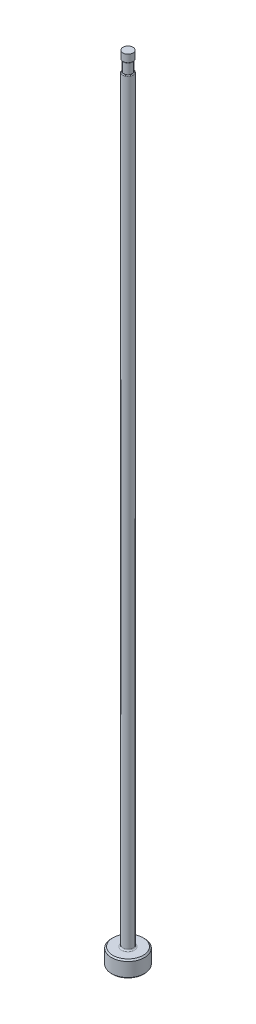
ISO-10303-21;
HEADER;
FILE_DESCRIPTION(('STEP AP214'),'2;1');
FILE_NAME('part.step','',(''),(''),'','','');
FILE_SCHEMA(('AUTOMOTIVE_DESIGN { 1 0 10303 214 1 1 1 1 }'));
ENDSEC;
DATA;
#1=APPLICATION_CONTEXT('core data for automotive mechanical design processes');
#2=APPLICATION_PROTOCOL_DEFINITION('international standard','automotive_design',2000,#1);
#3=PRODUCT_CONTEXT('',#1,'mechanical');
#4=PRODUCT('Part','Part','',(#3));
#5=PRODUCT_RELATED_PRODUCT_CATEGORY('part','',(#4));
#6=PRODUCT_DEFINITION_FORMATION('','',#4);
#7=PRODUCT_DEFINITION_CONTEXT('part definition',#1,'design');
#8=PRODUCT_DEFINITION('design','',#6,#7);
#9=PRODUCT_DEFINITION_SHAPE('','',#8);
#10=(LENGTH_UNIT() NAMED_UNIT(*) SI_UNIT(.MILLI.,.METRE.));
#11=(NAMED_UNIT(*) PLANE_ANGLE_UNIT() SI_UNIT($,.RADIAN.));
#12=(NAMED_UNIT(*) SI_UNIT($,.STERADIAN.) SOLID_ANGLE_UNIT());
#13=UNCERTAINTY_MEASURE_WITH_UNIT(LENGTH_MEASURE(1.E-05),#10,'distance_accuracy_value','');
#14=(GEOMETRIC_REPRESENTATION_CONTEXT(3) GLOBAL_UNCERTAINTY_ASSIGNED_CONTEXT((#13)) GLOBAL_UNIT_ASSIGNED_CONTEXT((#10,
#11,#12)) REPRESENTATION_CONTEXT('',''));
#15=CARTESIAN_POINT('',(0.,0.,0.));
#16=DIRECTION('',(0.,0.,1.));
#17=DIRECTION('',(1.,0.,0.));
#18=AXIS2_PLACEMENT_3D('',#15,#16,#17);
#19=CARTESIAN_POINT('',(-0.991869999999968,150.876,0.));
#20=DIRECTION('',(0.,1.,0.));
#21=DIRECTION('',(0.,0.,1.));
#22=AXIS2_PLACEMENT_3D('',#19,#20,#21);
#23=PLANE('',#22);
#24=CARTESIAN_POINT('',(0.,150.876,0.));
#25=DIRECTION('',(0.,1.,0.));
#26=DIRECTION('',(0.,0.,1.));
#27=AXIS2_PLACEMENT_3D('',#24,#25,#26);
#28=CIRCLE('',#27,0.839469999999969);
#29=CARTESIAN_POINT('',(0.,150.876,0.839469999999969));
#30=VERTEX_POINT('',#29);
#31=EDGE_CURVE('E11',#30,#30,#28,.F.);
#32=ORIENTED_EDGE('',*,*,#31,.T.);
#33=EDGE_LOOP('',(#32));
#34=FACE_BOUND('',#33,.T.);
#35=CARTESIAN_POINT('',(0.,150.876,0.));
#36=DIRECTION('',(0.,1.,0.));
#37=DIRECTION('',(0.,0.,1.));
#38=AXIS2_PLACEMENT_3D('',#35,#36,#37);
#39=CIRCLE('',#38,0.788669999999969);
#40=CARTESIAN_POINT('',(0.,150.876,0.788669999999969));
#41=VERTEX_POINT('',#40);
#42=EDGE_CURVE('E78',#41,#41,#39,.T.);
#43=ORIENTED_EDGE('',*,*,#42,.T.);
#44=EDGE_LOOP('',(#43));
#45=FACE_BOUND('',#44,.T.);
#46=ADVANCED_FACE('F36',(#34,#45),#23,.F.);
#47=CARTESIAN_POINT('',(0.,259.958771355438,0.));
#48=DIRECTION('',(0.,1.,0.));
#49=DIRECTION('',(0.,0.,1.));
#50=AXIS2_PLACEMENT_3D('',#47,#48,#49);
#51=CYLINDRICAL_SURFACE('',#50,0.991869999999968);
#52=DIRECTION('',(0.,1.,0.));
#53=VECTOR('',#52,1.);
#54=CARTESIAN_POINT('',(-0.788669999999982,259.958771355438,-0.601502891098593));
#55=LINE('',#54,#53);
#56=CARTESIAN_POINT('',(-0.788669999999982,148.717,-0.601502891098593));
#57=VERTEX_POINT('',#56);
#58=CARTESIAN_POINT('',(-0.788669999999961,86.36,-0.601502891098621));
#59=VERTEX_POINT('',#58);
#60=EDGE_CURVE('E73',#57,#59,#55,.F.);
#61=ORIENTED_EDGE('',*,*,#60,.F.);
#62=CARTESIAN_POINT('',(0.,148.717,0.));
#63=DIRECTION('',(0.,-1.,0.));
#64=DIRECTION('',(0.,0.,-1.));
#65=AXIS2_PLACEMENT_3D('',#62,#63,#64);
#66=CIRCLE('',#65,0.991869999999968);
#67=CARTESIAN_POINT('',(-0.788669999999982,148.717,0.601502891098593));
#68=VERTEX_POINT('',#67);
#69=EDGE_CURVE('E51',#57,#68,#66,.T.);
#70=ORIENTED_EDGE('',*,*,#69,.T.);
#71=DIRECTION('',(0.,1.,0.));
#72=VECTOR('',#71,1.);
#73=CARTESIAN_POINT('',(-0.788669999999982,259.958771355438,0.601502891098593));
#74=LINE('',#73,#72);
#75=CARTESIAN_POINT('',(-0.788669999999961,86.36,0.601502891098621));
#76=VERTEX_POINT('',#75);
#77=EDGE_CURVE('E84',#76,#68,#74,.T.);
#78=ORIENTED_EDGE('',*,*,#77,.F.);
#79=CARTESIAN_POINT('',(-0.78866999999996,86.36,-0.601502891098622));
#80=CARTESIAN_POINT('',(-0.788666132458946,86.3183657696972,-0.601487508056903));
#81=CARTESIAN_POINT('',(-0.789488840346,86.2767268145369,-0.600428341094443));
#82=CARTESIAN_POINT('',(-0.792762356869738,86.1935772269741,-0.596110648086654));
#83=CARTESIAN_POINT('',(-0.795215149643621,86.1520668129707,-0.5928494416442));
#84=CARTESIAN_POINT('',(-0.801750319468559,86.0690760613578,-0.583979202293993));
#85=CARTESIAN_POINT('',(-0.80584587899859,86.0275987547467,-0.578351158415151));
#86=CARTESIAN_POINT('',(-0.815598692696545,85.9452848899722,-0.564514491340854));
#87=CARTESIAN_POINT('',(-0.821255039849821,85.9044479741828,-0.556307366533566));
#88=CARTESIAN_POINT('',(-0.835799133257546,85.8124854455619,-0.534292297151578));
#89=CARTESIAN_POINT('',(-0.845147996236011,85.7616464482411,-0.51956237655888));
#90=CARTESIAN_POINT('',(-0.865829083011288,85.6624630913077,-0.484320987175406));
#91=CARTESIAN_POINT('',(-0.877157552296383,85.6141142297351,-0.463820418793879));
#92=CARTESIAN_POINT('',(-0.898053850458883,85.5330057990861,-0.421558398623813));
#93=CARTESIAN_POINT('',(-0.907358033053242,85.4993614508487,-0.401380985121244));
#94=CARTESIAN_POINT('',(-0.926056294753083,85.4355419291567,-0.356125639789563));
#95=CARTESIAN_POINT('',(-0.935450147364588,85.4053597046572,-0.331057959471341));
#96=CARTESIAN_POINT('',(-0.950231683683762,85.3599121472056,-0.285005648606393));
#97=CARTESIAN_POINT('',(-0.955876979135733,85.3431082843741,-0.265630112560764));
#98=CARTESIAN_POINT('',(-0.966384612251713,85.312543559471,-0.224405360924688));
#99=CARTESIAN_POINT('',(-0.971247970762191,85.2987787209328,-0.202559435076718));
#100=CARTESIAN_POINT('',(-0.978947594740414,85.2773348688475,-0.16073053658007));
#101=CARTESIAN_POINT('',(-0.981991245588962,85.2690060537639,-0.141121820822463));
#102=CARTESIAN_POINT('',(-0.986954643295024,85.2555350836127,-0.100697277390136));
#103=CARTESIAN_POINT('',(-0.988875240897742,85.2503905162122,-0.0798823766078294));
#104=CARTESIAN_POINT('',(-0.991389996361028,85.2436710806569,-0.0374802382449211));
#105=CARTESIAN_POINT('',(-0.991977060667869,85.2421153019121,-0.0158894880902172));
#106=CARTESIAN_POINT('',(-0.991730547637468,85.2427708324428,0.0272258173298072));
#107=CARTESIAN_POINT('',(-0.990897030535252,85.2449819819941,0.0487503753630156));
#108=CARTESIAN_POINT('',(-0.988037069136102,85.2526392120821,0.0892607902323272));
#109=CARTESIAN_POINT('',(-0.986115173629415,85.257802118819,0.108309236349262));
#110=CARTESIAN_POINT('',(-0.98134109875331,85.2707860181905,0.145344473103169));
#111=CARTESIAN_POINT('',(-0.978488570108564,85.2786080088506,0.163330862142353));
#112=CARTESIAN_POINT('',(-0.970708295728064,85.3002895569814,0.205331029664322));
#113=CARTESIAN_POINT('',(-0.96541298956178,85.3153036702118,0.228680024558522));
#114=CARTESIAN_POINT('',(-0.953964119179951,85.3487581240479,0.272534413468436));
#115=CARTESIAN_POINT('',(-0.947808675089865,85.3672059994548,0.293033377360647));
#116=CARTESIAN_POINT('',(-0.931801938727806,85.4169271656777,0.341318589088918));
#117=CARTESIAN_POINT('',(-0.921702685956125,85.4498591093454,0.367302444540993));
#118=CARTESIAN_POINT('',(-0.901756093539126,85.5193884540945,0.413864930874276));
#119=CARTESIAN_POINT('',(-0.891909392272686,85.5559941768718,0.434430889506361));
#120=CARTESIAN_POINT('',(-0.874578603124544,85.6256825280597,0.468207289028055));
#121=CARTESIAN_POINT('',(-0.866965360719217,85.6584263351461,0.482064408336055));
#122=CARTESIAN_POINT('',(-0.852602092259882,85.72513810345,0.507032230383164));
#123=CARTESIAN_POINT('',(-0.845852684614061,85.7591069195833,0.518140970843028));
#124=CARTESIAN_POINT('',(-0.827119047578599,85.8624444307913,0.547946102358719));
#125=CARTESIAN_POINT('',(-0.816676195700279,85.9331386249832,0.56307398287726));
#126=CARTESIAN_POINT('',(-0.801997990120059,86.063402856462,0.583716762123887));
#127=CARTESIAN_POINT('',(-0.796987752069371,86.1227084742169,0.590464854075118));
#128=CARTESIAN_POINT('',(-0.791992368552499,86.21180696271,0.597127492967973));
#129=CARTESIAN_POINT('',(-0.790747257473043,86.2414091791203,0.598772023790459));
#130=CARTESIAN_POINT('',(-0.789085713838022,86.3006736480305,0.600958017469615));
#131=CARTESIAN_POINT('',(-0.788669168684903,86.3303358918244,0.601499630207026));
#132=CARTESIAN_POINT('',(-0.788669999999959,86.36,0.601502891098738));
#133=B_SPLINE_CURVE_WITH_KNOTS('',3,(#79,#80,#81,#82,#83,#84,#85,#86,#87,#88,#89,#90,#91,#92,
#93,#94,#95,#96,#97,#98,#99,#100,#101,#102,#103,#104,#105,#106,#107,#108,#109,#110,#111,#112,
#113,#114,#115,#116,#117,#118,#119,#120,#121,#122,#123,#124,#125,#126,#127,#128,#129,#130,#131,
#132),.UNSPECIFIED.,.F.,.F.,(4,2,2,2,2,2,2,2,2,2,2,2,2,2,2,2,2,2,2,2,2,2,2,2,2,2,4),(0.,
0.124888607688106,0.249929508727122,0.375994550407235,0.501986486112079,0.662910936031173,
0.823533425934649,0.944174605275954,1.06456554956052,1.14311274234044,1.22155654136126,
1.28585720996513,1.350109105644,1.41470198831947,1.47929213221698,1.53853130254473,
1.59779273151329,1.68209646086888,1.76658740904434,1.89530637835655,2.02432379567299,
2.13325396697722,2.24226168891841,2.46062960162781,2.64005592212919,2.72904839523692,
2.81802877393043),.UNSPECIFIED.);
#134=EDGE_CURVE('E81',#59,#76,#133,.T.);
#135=ORIENTED_EDGE('',*,*,#134,.F.);
#136=EDGE_LOOP('',(#61,#70,#78,#135));
#137=FACE_BOUND('',#136,.T.);
#138=CARTESIAN_POINT('',(0.,3.42900000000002,0.));
#139=DIRECTION('',(0.,1.,0.));
#140=DIRECTION('',(0.,0.,1.));
#141=AXIS2_PLACEMENT_3D('',#138,#139,#140);
#142=CIRCLE('',#141,0.991869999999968);
#143=CARTESIAN_POINT('',(0.,3.42900000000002,0.991869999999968));
#144=VERTEX_POINT('',#143);
#145=EDGE_CURVE('E116',#144,#144,#142,.T.);
#146=ORIENTED_EDGE('',*,*,#145,.T.);
#147=EDGE_LOOP('',(#146));
#148=FACE_BOUND('',#147,.T.);
#149=ADVANCED_FACE('F82',(#137,#148),#51,.T.);
#150=CARTESIAN_POINT('',(0.,0.,0.));
#151=DIRECTION('',(0.,-1.,0.));
#152=DIRECTION('',(0.,0.,-1.));
#153=AXIS2_PLACEMENT_3D('',#150,#151,#152);
#154=PLANE('',#153);
#155=CARTESIAN_POINT('',(0.,0.,0.));
#156=DIRECTION('',(0.,-1.,0.));
#157=DIRECTION('',(0.,0.,-1.));
#158=AXIS2_PLACEMENT_3D('',#155,#156,#157);
#159=CIRCLE('',#158,2.92099999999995);
#160=CARTESIAN_POINT('',(0.,0.,-2.92099999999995));
#161=VERTEX_POINT('',#160);
#162=EDGE_CURVE('E113',#161,#161,#159,.T.);
#163=ORIENTED_EDGE('',*,*,#162,.T.);
#164=EDGE_LOOP('',(#163));
#165=FACE_BOUND('',#164,.T.);
#166=ADVANCED_FACE('F192',(#165),#154,.T.);
#167=CARTESIAN_POINT('',(0.,259.958771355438,0.));
#168=DIRECTION('',(0.,1.,0.));
#169=DIRECTION('',(0.,0.,1.));
#170=AXIS2_PLACEMENT_3D('',#167,#168,#169);
#171=CYLINDRICAL_SURFACE('',#170,3.17499999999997);
#172=CARTESIAN_POINT('',(0.,2.92100000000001,0.));
#173=DIRECTION('',(0.,1.,0.));
#174=DIRECTION('',(0.,0.,1.));
#175=AXIS2_PLACEMENT_3D('',#172,#173,#174);
#176=CIRCLE('',#175,3.17499999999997);
#177=CARTESIAN_POINT('',(0.,2.92100000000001,3.17499999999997));
#178=VERTEX_POINT('',#177);
#179=EDGE_CURVE('E110',#178,#178,#176,.F.);
#180=ORIENTED_EDGE('',*,*,#179,.T.);
#181=EDGE_LOOP('',(#180));
#182=FACE_BOUND('',#181,.T.);
#183=CARTESIAN_POINT('',(0.,0.254000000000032,0.));
#184=DIRECTION('',(0.,-1.,0.));
#185=DIRECTION('',(0.,0.,-1.));
#186=AXIS2_PLACEMENT_3D('',#183,#184,#185);
#187=CIRCLE('',#186,3.17499999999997);
#188=CARTESIAN_POINT('',(0.,0.254000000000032,-3.17499999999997));
#189=VERTEX_POINT('',#188);
#190=EDGE_CURVE('E107',#189,#189,#187,.F.);
#191=ORIENTED_EDGE('',*,*,#190,.T.);
#192=EDGE_LOOP('',(#191));
#193=FACE_BOUND('',#192,.T.);
#194=ADVANCED_FACE('F195',(#182,#193),#171,.T.);
#195=CARTESIAN_POINT('',(-3.17499999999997,3.175,0.));
#196=DIRECTION('',(0.,1.,0.));
#197=DIRECTION('',(0.,0.,1.));
#198=AXIS2_PLACEMENT_3D('',#195,#196,#197);
#199=PLANE('',#198);
#200=CARTESIAN_POINT('',(0.,3.175,0.));
#201=DIRECTION('',(0.,1.,0.));
#202=DIRECTION('',(0.,0.,1.));
#203=AXIS2_PLACEMENT_3D('',#200,#201,#202);
#204=CIRCLE('',#203,1.24586999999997);
#205=CARTESIAN_POINT('',(0.,3.175,1.24586999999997));
#206=VERTEX_POINT('',#205);
#207=EDGE_CURVE('E87',#206,#206,#204,.F.);
#208=ORIENTED_EDGE('',*,*,#207,.T.);
#209=EDGE_LOOP('',(#208));
#210=FACE_BOUND('',#209,.T.);
#211=CARTESIAN_POINT('',(0.,3.175,0.));
#212=DIRECTION('',(0.,1.,0.));
#213=DIRECTION('',(0.,0.,1.));
#214=AXIS2_PLACEMENT_3D('',#211,#212,#213);
#215=CIRCLE('',#214,2.92099999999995);
#216=CARTESIAN_POINT('',(0.,3.175,2.92099999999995));
#217=VERTEX_POINT('',#216);
#218=EDGE_CURVE('E104',#217,#217,#215,.T.);
#219=ORIENTED_EDGE('',*,*,#218,.T.);
#220=EDGE_LOOP('',(#219));
#221=FACE_BOUND('',#220,.T.);
#222=ADVANCED_FACE('F190',(#210,#221),#199,.T.);
#223=CARTESIAN_POINT('',(0.,3.17499999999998,0.));
#224=DIRECTION('',(0.,-1.,0.));
#225=DIRECTION('',(0.,0.,-1.));
#226=AXIS2_PLACEMENT_3D('',#223,#224,#225);
#227=CONICAL_SURFACE('',#226,2.92099999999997,0.7853981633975);
#228=ORIENTED_EDGE('',*,*,#179,.F.);
#229=EDGE_LOOP('',(#228));
#230=FACE_BOUND('',#229,.T.);
#231=ORIENTED_EDGE('',*,*,#218,.F.);
#232=EDGE_LOOP('',(#231));
#233=FACE_BOUND('',#232,.T.);
#234=ADVANCED_FACE('F186',(#230,#233),#227,.T.);
#235=CARTESIAN_POINT('',(0.,0.254000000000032,0.));
#236=DIRECTION('',(0.,1.,0.));
#237=DIRECTION('',(0.,0.,1.));
#238=AXIS2_PLACEMENT_3D('',#235,#236,#237);
#239=CONICAL_SURFACE('',#238,3.17499999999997,0.785398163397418);
#240=ORIENTED_EDGE('',*,*,#162,.F.);
#241=EDGE_LOOP('',(#240));
#242=FACE_BOUND('',#241,.T.);
#243=ORIENTED_EDGE('',*,*,#190,.F.);
#244=EDGE_LOOP('',(#243));
#245=FACE_BOUND('',#244,.T.);
#246=ADVANCED_FACE('F182',(#242,#245),#239,.T.);
#247=CARTESIAN_POINT('',(0.,3.42900000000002,0.));
#248=DIRECTION('',(0.,1.,0.));
#249=DIRECTION('',(0.,0.,1.));
#250=AXIS2_PLACEMENT_3D('',#247,#248,#249);
#251=TOROIDAL_SURFACE('',#250,1.24586999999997,0.254);
#252=ORIENTED_EDGE('',*,*,#207,.F.);
#253=EDGE_LOOP('',(#252));
#254=FACE_BOUND('',#253,.T.);
#255=ORIENTED_EDGE('',*,*,#145,.F.);
#256=EDGE_LOOP('',(#255));
#257=FACE_BOUND('',#256,.T.);
#258=ADVANCED_FACE('F147',(#254,#257),#251,.F.);
#259=CARTESIAN_POINT('',(-0.991869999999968,148.844,0.));
#260=DIRECTION('',(0.,-1.,0.));
#261=DIRECTION('',(0.,0.,-1.));
#262=AXIS2_PLACEMENT_3D('',#259,#260,#261);
#263=PLANE('',#262);
#264=DIRECTION('',(0.,0.,1.));
#265=VECTOR('',#264,1.);
#266=CARTESIAN_POINT('',(-0.788669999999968,148.844,0.));
#267=LINE('',#266,#265);
#268=CARTESIAN_POINT('',(-0.788669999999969,148.844,0.));
#269=VERTEX_POINT('',#268);
#270=CARTESIAN_POINT('',(-0.788669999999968,148.844,0.354964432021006));
#271=VERTEX_POINT('',#270);
#272=EDGE_CURVE('E90',#269,#271,#267,.T.);
#273=ORIENTED_EDGE('',*,*,#272,.T.);
#274=CARTESIAN_POINT('',(0.,148.844,0.));
#275=DIRECTION('',(0.,-1.,0.));
#276=DIRECTION('',(0.,0.,-1.));
#277=AXIS2_PLACEMENT_3D('',#274,#275,#276);
#278=CIRCLE('',#277,0.864869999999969);
#279=CARTESIAN_POINT('',(-0.788669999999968,148.844,-0.354964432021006));
#280=VERTEX_POINT('',#279);
#281=EDGE_CURVE('E86',#271,#280,#278,.F.);
#282=ORIENTED_EDGE('',*,*,#281,.T.);
#283=EDGE_CURVE('E79',#280,#269,#267,.T.);
#284=ORIENTED_EDGE('',*,*,#283,.T.);
#285=CARTESIAN_POINT('',(0.,148.844,0.));
#286=DIRECTION('',(0.,1.,0.));
#287=DIRECTION('',(0.,0.,1.));
#288=AXIS2_PLACEMENT_3D('',#285,#286,#287);
#289=CIRCLE('',#288,0.788669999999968);
#290=EDGE_CURVE('E101',#269,#269,#289,.T.);
#291=ORIENTED_EDGE('',*,*,#290,.F.);
#292=EDGE_LOOP('',(#273,#282,#284,#291));
#293=FACE_BOUND('',#292,.T.);
#294=ADVANCED_FACE('F144',(#293),#263,.F.);
#295=CARTESIAN_POINT('',(0.,153.448281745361,0.));
#296=DIRECTION('',(0.,1.,0.));
#297=DIRECTION('',(0.,0.,1.));
#298=AXIS2_PLACEMENT_3D('',#295,#296,#297);
#299=CYLINDRICAL_SURFACE('',#298,0.788669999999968);
#300=ORIENTED_EDGE('',*,*,#42,.F.);
#301=EDGE_LOOP('',(#300));
#302=FACE_BOUND('',#301,.T.);
#303=ORIENTED_EDGE('',*,*,#290,.T.);
#304=EDGE_LOOP('',(#303));
#305=FACE_BOUND('',#304,.T.);
#306=ADVANCED_FACE('F141',(#302,#305),#299,.T.);
#307=CARTESIAN_POINT('',(-0.788669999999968,149.86,-3.17499999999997));
#308=DIRECTION('',(1.,0.,0.));
#309=DIRECTION('',(0.,1.,0.));
#310=AXIS2_PLACEMENT_3D('',#307,#308,#309);
#311=PLANE('',#310);
#312=ORIENTED_EDGE('',*,*,#283,.F.);
#313=CARTESIAN_POINT('',(-0.788669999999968,148.844,-0.354964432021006));
#314=CARTESIAN_POINT('',(-0.788669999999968,148.843991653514,-0.368137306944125));
#315=CARTESIAN_POINT('',(-0.788669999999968,148.843653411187,-0.381328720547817));
#316=CARTESIAN_POINT('',(-0.788669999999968,148.842063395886,-0.407789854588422));
#317=CARTESIAN_POINT('',(-0.788669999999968,148.840802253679,-0.421058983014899));
#318=CARTESIAN_POINT('',(-0.788669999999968,148.837062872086,-0.447724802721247));
#319=CARTESIAN_POINT('',(-0.788669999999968,148.834559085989,-0.461118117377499));
#320=CARTESIAN_POINT('',(-0.788669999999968,148.827968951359,-0.487472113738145));
#321=CARTESIAN_POINT('',(-0.788669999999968,148.823890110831,-0.50043453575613));
#322=CARTESIAN_POINT('',(-0.788669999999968,148.816061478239,-0.519670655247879));
#323=CARTESIAN_POINT('',(-0.788669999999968,148.81304648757,-0.526242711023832));
#324=CARTESIAN_POINT('',(-0.788669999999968,148.806344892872,-0.539027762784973));
#325=CARTESIAN_POINT('',(-0.788669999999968,148.802659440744,-0.545241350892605));
#326=CARTESIAN_POINT('',(-0.788669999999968,148.794480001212,-0.5572118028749));
#327=CARTESIAN_POINT('',(-0.788669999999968,148.789978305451,-0.562963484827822));
#328=CARTESIAN_POINT('',(-0.788669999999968,148.780105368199,-0.573676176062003));
#329=CARTESIAN_POINT('',(-0.788669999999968,148.774735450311,-0.578638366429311));
#330=CARTESIAN_POINT('',(-0.788669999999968,148.764914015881,-0.586040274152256));
#331=CARTESIAN_POINT('',(-0.788669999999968,148.760693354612,-0.588785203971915));
#332=CARTESIAN_POINT('',(-0.788669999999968,148.751874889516,-0.593566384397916));
#333=CARTESIAN_POINT('',(-0.788669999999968,148.747278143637,-0.595604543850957));
#334=CARTESIAN_POINT('',(-0.788669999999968,148.73844552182,-0.598606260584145));
#335=CARTESIAN_POINT('',(-0.788669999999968,148.734247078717,-0.599679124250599));
#336=CARTESIAN_POINT('',(-0.788669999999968,148.72570249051,-0.601133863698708));
#337=CARTESIAN_POINT('',(-0.788669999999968,148.721355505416,-0.601510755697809));
#338=CARTESIAN_POINT('',(-0.788669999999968,148.717,-0.601502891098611));
#339=B_SPLINE_CURVE_WITH_KNOTS('',3,(#313,#314,#315,#316,#317,#318,#319,#320,#321,#322,#323,
#324,#325,#326,#327,#328,#329,#330,#331,#332,#333,#334,#335,#336,#337,#338),.UNSPECIFIED.,.F.,
.F.,(4,2,2,2,2,2,2,2,2,2,2,2,4),(0.,0.0395434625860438,0.07949403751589,0.120302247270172,
0.160918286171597,0.182579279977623,0.204203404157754,0.22604352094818,0.24785065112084,
0.262901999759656,0.277912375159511,0.290856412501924,0.303892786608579),.UNSPECIFIED.);
#340=EDGE_CURVE('E59',#280,#57,#339,.T.);
#341=ORIENTED_EDGE('',*,*,#340,.T.);
#342=ORIENTED_EDGE('',*,*,#60,.T.);
#343=DIRECTION('',(0.,0.,1.));
#344=VECTOR('',#343,1.);
#345=CARTESIAN_POINT('',(-0.788669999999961,86.36,-3.17499999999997));
#346=LINE('',#345,#344);
#347=EDGE_CURVE('E77',#59,#76,#346,.T.);
#348=ORIENTED_EDGE('',*,*,#347,.T.);
#349=ORIENTED_EDGE('',*,*,#77,.T.);
#350=CARTESIAN_POINT('',(-0.788669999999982,148.717,0.601502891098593));
#351=CARTESIAN_POINT('',(-0.788669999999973,148.722166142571,0.601517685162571));
#352=CARTESIAN_POINT('',(-0.78866999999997,148.727314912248,0.600984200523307));
#353=CARTESIAN_POINT('',(-0.788669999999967,148.737363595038,0.598952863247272));
#354=CARTESIAN_POINT('',(-0.788669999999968,148.742265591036,0.597465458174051));
#355=CARTESIAN_POINT('',(-0.788669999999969,148.751706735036,0.59366073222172));
#356=CARTESIAN_POINT('',(-0.788669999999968,148.756247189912,0.591346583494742));
#357=CARTESIAN_POINT('',(-0.788669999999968,148.764926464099,0.586045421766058));
#358=CARTESIAN_POINT('',(-0.788669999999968,148.769064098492,0.583056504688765));
#359=CARTESIAN_POINT('',(-0.788669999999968,148.778796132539,0.574987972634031));
#360=CARTESIAN_POINT('',(-0.788669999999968,148.784130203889,0.569595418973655));
#361=CARTESIAN_POINT('',(-0.788669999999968,148.793886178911,0.558050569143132));
#362=CARTESIAN_POINT('',(-0.788669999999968,148.798306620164,0.551897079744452));
#363=CARTESIAN_POINT('',(-0.788669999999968,148.808844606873,0.535097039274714));
#364=CARTESIAN_POINT('',(-0.788669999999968,148.814303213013,0.524040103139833));
#365=CARTESIAN_POINT('',(-0.788669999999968,148.823553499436,0.501210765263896));
#366=CARTESIAN_POINT('',(-0.788669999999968,148.827334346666,0.489434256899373));
#367=CARTESIAN_POINT('',(-0.788669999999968,148.835711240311,0.457304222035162));
#368=CARTESIAN_POINT('',(-0.788669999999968,148.839073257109,0.436633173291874));
#369=CARTESIAN_POINT('',(-0.788669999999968,148.842171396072,0.405739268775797));
#370=CARTESIAN_POINT('',(-0.788669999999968,148.842882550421,0.395580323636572));
#371=CARTESIAN_POINT('',(-0.788669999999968,148.843795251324,0.375270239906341));
#372=CARTESIAN_POINT('',(-0.788669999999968,148.843998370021,0.365119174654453));
#373=CARTESIAN_POINT('',(-0.788669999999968,148.844,0.354964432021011));
#374=B_SPLINE_CURVE_WITH_KNOTS('',3,(#350,#351,#352,#353,#354,#355,#356,#357,#358,#359,#360,
#361,#362,#363,#364,#365,#366,#367,#368,#369,#370,#371,#372,#373),.UNSPECIFIED.,.F.,.F.,(4,2,2,
2,2,2,2,2,2,2,2,4),(0.,0.0154434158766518,0.0307205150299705,0.0459396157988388,
0.0612022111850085,0.0838287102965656,0.106491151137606,0.143275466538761,0.180293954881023,
0.242825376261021,0.273372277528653,0.303824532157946),.UNSPECIFIED.);
#375=EDGE_CURVE('E172',#68,#271,#374,.T.);
#376=ORIENTED_EDGE('',*,*,#375,.T.);
#377=ORIENTED_EDGE('',*,*,#272,.F.);
#378=EDGE_LOOP('',(#312,#341,#342,#348,#349,#376,#377));
#379=FACE_BOUND('',#378,.T.);
#380=ADVANCED_FACE('F75',(#379),#311,.F.);
#381=CARTESIAN_POINT('',(-3.96366999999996,86.36,-3.17499999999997));
#382=DIRECTION('',(0.,0.,1.));
#383=DIRECTION('',(1.,0.,0.));
#384=AXIS2_PLACEMENT_3D('',#381,#382,#383);
#385=CYLINDRICAL_SURFACE('',#384,3.175);
#386=ORIENTED_EDGE('',*,*,#347,.F.);
#387=ORIENTED_EDGE('',*,*,#134,.T.);
#388=EDGE_LOOP('',(#386,#387));
#389=FACE_BOUND('',#388,.T.);
#390=ADVANCED_FACE('F89',(#389),#385,.F.);
#391=CARTESIAN_POINT('',(0.,152.687735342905,0.));
#392=DIRECTION('',(0.,1.,0.));
#393=DIRECTION('',(0.,0.,1.));
#394=AXIS2_PLACEMENT_3D('',#391,#392,#393);
#395=CYLINDRICAL_SURFACE('',#394,0.966469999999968);
#396=CARTESIAN_POINT('',(0.,151.003,0.));
#397=DIRECTION('',(0.,1.,0.));
#398=DIRECTION('',(0.,0.,1.));
#399=AXIS2_PLACEMENT_3D('',#396,#397,#398);
#400=CIRCLE('',#399,0.966469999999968);
#401=CARTESIAN_POINT('',(0.,151.003,0.966469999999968));
#402=VERTEX_POINT('',#401);
#403=EDGE_CURVE('E44',#402,#402,#400,.T.);
#404=ORIENTED_EDGE('',*,*,#403,.T.);
#405=EDGE_LOOP('',(#404));
#406=FACE_BOUND('',#405,.T.);
#407=CARTESIAN_POINT('',(0.,152.4,0.));
#408=DIRECTION('',(0.,1.,0.));
#409=DIRECTION('',(0.,0.,1.));
#410=AXIS2_PLACEMENT_3D('',#407,#408,#409);
#411=CIRCLE('',#410,0.966469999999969);
#412=CARTESIAN_POINT('',(0.,152.4,0.966469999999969));
#413=VERTEX_POINT('',#412);
#414=EDGE_CURVE('E91',#413,#413,#411,.T.);
#415=ORIENTED_EDGE('',*,*,#414,.F.);
#416=EDGE_LOOP('',(#415));
#417=FACE_BOUND('',#416,.T.);
#418=ADVANCED_FACE('F135',(#406,#417),#395,.T.);
#419=CARTESIAN_POINT('',(-0.991869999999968,152.4,0.));
#420=DIRECTION('',(0.,1.,0.));
#421=DIRECTION('',(0.,0.,1.));
#422=AXIS2_PLACEMENT_3D('',#419,#420,#421);
#423=PLANE('',#422);
#424=ORIENTED_EDGE('',*,*,#414,.T.);
#425=EDGE_LOOP('',(#424));
#426=FACE_BOUND('',#425,.T.);
#427=ADVANCED_FACE('F149',(#426),#423,.T.);
#428=CARTESIAN_POINT('',(0.,148.717,0.));
#429=DIRECTION('',(0.,-1.,0.));
#430=DIRECTION('',(0.,0.,-1.));
#431=AXIS2_PLACEMENT_3D('',#428,#429,#430);
#432=TOROIDAL_SURFACE('',#431,0.864869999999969,0.127);
#433=ORIENTED_EDGE('',*,*,#375,.F.);
#434=ORIENTED_EDGE('',*,*,#69,.F.);
#435=ORIENTED_EDGE('',*,*,#340,.F.);
#436=ORIENTED_EDGE('',*,*,#281,.F.);
#437=EDGE_LOOP('',(#433,#434,#435,#436));
#438=FACE_BOUND('',#437,.T.);
#439=ADVANCED_FACE('F151',(#438),#432,.T.);
#440=CARTESIAN_POINT('',(0.,151.003,0.));
#441=DIRECTION('',(0.,1.,0.));
#442=DIRECTION('',(0.,0.,1.));
#443=AXIS2_PLACEMENT_3D('',#440,#441,#442);
#444=TOROIDAL_SURFACE('',#443,0.839469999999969,0.127);
#445=ORIENTED_EDGE('',*,*,#31,.F.);
#446=EDGE_LOOP('',(#445));
#447=FACE_BOUND('',#446,.T.);
#448=ORIENTED_EDGE('',*,*,#403,.F.);
#449=EDGE_LOOP('',(#448));
#450=FACE_BOUND('',#449,.T.);
#451=ADVANCED_FACE('F38',(#447,#450),#444,.T.);
#452=CLOSED_SHELL('',(#46,#149,#166,#194,#222,#234,#246,#258,#294,#306,#380,#390,#418,#427,#439,#451));
#453=MANIFOLD_SOLID_BREP('B2',#452);
#454=ADVANCED_BREP_SHAPE_REPRESENTATION('',(#18,#453),#14);
#455=SHAPE_DEFINITION_REPRESENTATION(#9,#454);
ENDSEC;
END-ISO-10303-21;
